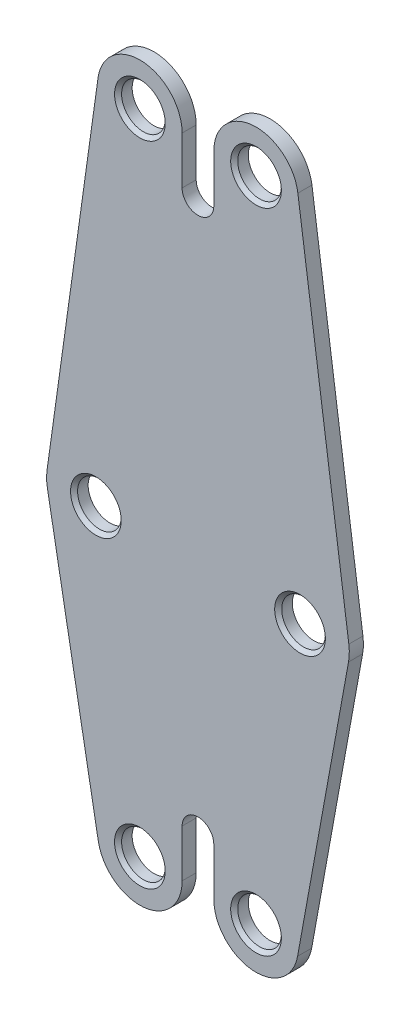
ISO-10303-21;
HEADER;
FILE_DESCRIPTION(('STEP AP214'),'2;1');
FILE_NAME('part.step','',(''),(''),'','','');
FILE_SCHEMA(('AUTOMOTIVE_DESIGN { 1 0 10303 214 1 1 1 1 }'));
ENDSEC;
DATA;
#1=APPLICATION_CONTEXT('core data for automotive mechanical design processes');
#2=APPLICATION_PROTOCOL_DEFINITION('international standard','automotive_design',2000,#1);
#3=PRODUCT_CONTEXT('',#1,'mechanical');
#4=PRODUCT('Part','Part','',(#3));
#5=PRODUCT_RELATED_PRODUCT_CATEGORY('part','',(#4));
#6=PRODUCT_DEFINITION_FORMATION('','',#4);
#7=PRODUCT_DEFINITION_CONTEXT('part definition',#1,'design');
#8=PRODUCT_DEFINITION('design','',#6,#7);
#9=PRODUCT_DEFINITION_SHAPE('','',#8);
#10=(LENGTH_UNIT() NAMED_UNIT(*) SI_UNIT(.MILLI.,.METRE.));
#11=(NAMED_UNIT(*) PLANE_ANGLE_UNIT() SI_UNIT($,.RADIAN.));
#12=(NAMED_UNIT(*) SI_UNIT($,.STERADIAN.) SOLID_ANGLE_UNIT());
#13=UNCERTAINTY_MEASURE_WITH_UNIT(LENGTH_MEASURE(1.E-05),#10,'distance_accuracy_value','');
#14=(GEOMETRIC_REPRESENTATION_CONTEXT(3) GLOBAL_UNCERTAINTY_ASSIGNED_CONTEXT((#13)) GLOBAL_UNIT_ASSIGNED_CONTEXT((#10,
#11,#12)) REPRESENTATION_CONTEXT('',''));
#15=CARTESIAN_POINT('',(0.,0.,0.));
#16=DIRECTION('',(0.,0.,1.));
#17=DIRECTION('',(1.,0.,0.));
#18=AXIS2_PLACEMENT_3D('',#15,#16,#17);
#19=CARTESIAN_POINT('',(-14.5,0.,2.));
#20=DIRECTION('',(0.,0.,1.));
#21=DIRECTION('',(1.,0.,0.));
#22=AXIS2_PLACEMENT_3D('',#19,#20,#21);
#23=PLANE('',#22);
#24=CARTESIAN_POINT('',(-8.25000000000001,52.,2.));
#25=DIRECTION('',(0.,0.,1.));
#26=DIRECTION('',(1.,0.,0.));
#27=AXIS2_PLACEMENT_3D('',#24,#25,#26);
#28=CIRCLE('',#27,3.6);
#29=CARTESIAN_POINT('',(-4.65,52.,2.));
#30=VERTEX_POINT('',#29);
#31=EDGE_CURVE('E289',#30,#30,#28,.F.);
#32=ORIENTED_EDGE('',*,*,#31,.T.);
#33=EDGE_LOOP('',(#32));
#34=FACE_BOUND('',#33,.T.);
#35=CARTESIAN_POINT('',(8.24999999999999,52.,2.));
#36=DIRECTION('',(0.,0.,1.));
#37=DIRECTION('',(1.,0.,0.));
#38=AXIS2_PLACEMENT_3D('',#35,#36,#37);
#39=CIRCLE('',#38,3.6);
#40=CARTESIAN_POINT('',(11.85,52.,2.));
#41=VERTEX_POINT('',#40);
#42=EDGE_CURVE('E286',#41,#41,#39,.F.);
#43=ORIENTED_EDGE('',*,*,#42,.T.);
#44=EDGE_LOOP('',(#43));
#45=FACE_BOUND('',#44,.T.);
#46=CARTESIAN_POINT('',(-14.5,0.,2.));
#47=DIRECTION('',(0.,0.,1.));
#48=DIRECTION('',(1.,0.,0.));
#49=AXIS2_PLACEMENT_3D('',#46,#47,#48);
#50=CIRCLE('',#49,3.60000000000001);
#51=CARTESIAN_POINT('',(-10.9,0.,2.));
#52=VERTEX_POINT('',#51);
#53=EDGE_CURVE('E283',#52,#52,#50,.F.);
#54=ORIENTED_EDGE('',*,*,#53,.T.);
#55=EDGE_LOOP('',(#54));
#56=FACE_BOUND('',#55,.T.);
#57=CARTESIAN_POINT('',(14.5,0.,2.));
#58=DIRECTION('',(0.,0.,1.));
#59=DIRECTION('',(1.,0.,0.));
#60=AXIS2_PLACEMENT_3D('',#57,#58,#59);
#61=CIRCLE('',#60,3.6);
#62=CARTESIAN_POINT('',(18.1,0.,2.));
#63=VERTEX_POINT('',#62);
#64=EDGE_CURVE('E280',#63,#63,#61,.F.);
#65=ORIENTED_EDGE('',*,*,#64,.T.);
#66=EDGE_LOOP('',(#65));
#67=FACE_BOUND('',#66,.T.);
#68=CARTESIAN_POINT('',(-8.24999999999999,-40.,2.));
#69=DIRECTION('',(0.,0.,1.));
#70=DIRECTION('',(1.,0.,0.));
#71=AXIS2_PLACEMENT_3D('',#68,#69,#70);
#72=CIRCLE('',#71,3.6);
#73=CARTESIAN_POINT('',(-4.64999999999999,-40.,2.));
#74=VERTEX_POINT('',#73);
#75=EDGE_CURVE('E277',#74,#74,#72,.F.);
#76=ORIENTED_EDGE('',*,*,#75,.T.);
#77=EDGE_LOOP('',(#76));
#78=FACE_BOUND('',#77,.T.);
#79=CARTESIAN_POINT('',(8.25000000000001,-40.,2.));
#80=DIRECTION('',(0.,0.,1.));
#81=DIRECTION('',(1.,0.,0.));
#82=AXIS2_PLACEMENT_3D('',#79,#80,#81);
#83=CIRCLE('',#82,3.6);
#84=CARTESIAN_POINT('',(11.85,-40.,2.));
#85=VERTEX_POINT('',#84);
#86=EDGE_CURVE('E274',#85,#85,#83,.F.);
#87=ORIENTED_EDGE('',*,*,#86,.T.);
#88=EDGE_LOOP('',(#87));
#89=FACE_BOUND('',#88,.T.);
#90=CARTESIAN_POINT('',(-14.5,0.,2.));
#91=DIRECTION('',(0.,0.,1.));
#92=DIRECTION('',(1.,0.,0.));
#93=AXIS2_PLACEMENT_3D('',#90,#91,#92);
#94=CIRCLE('',#93,7.00000000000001);
#95=CARTESIAN_POINT('',(-21.4327633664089,0.967880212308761,2.));
#96=VERTEX_POINT('',#95);
#97=CARTESIAN_POINT('',(-21.3872820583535,-1.25113782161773,2.));
#98=VERTEX_POINT('',#97);
#99=EDGE_CURVE('E202',#96,#98,#94,.T.);
#100=ORIENTED_EDGE('',*,*,#99,.T.);
#101=DIRECTION('',(0.178733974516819,-0.983897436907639,0.));
#102=VECTOR('',#101,1.);
#103=CARTESIAN_POINT('',(-21.3872820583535,-1.25113782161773,2.));
#104=LINE('',#103,#102);
#105=CARTESIAN_POINT('',(-14.1533846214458,-41.0724038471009,2.));
#106=VERTEX_POINT('',#105);
#107=EDGE_CURVE('E160',#98,#106,#104,.T.);
#108=ORIENTED_EDGE('',*,*,#107,.T.);
#109=CARTESIAN_POINT('',(-8.24999999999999,-40.,2.));
#110=DIRECTION('',(0.,0.,1.));
#111=DIRECTION('',(1.,0.,0.));
#112=AXIS2_PLACEMENT_3D('',#109,#110,#111);
#113=CIRCLE('',#112,6.);
#114=CARTESIAN_POINT('',(-2.25,-40.,2.));
#115=VERTEX_POINT('',#114);
#116=EDGE_CURVE('E205',#106,#115,#113,.T.);
#117=ORIENTED_EDGE('',*,*,#116,.T.);
#118=DIRECTION('',(0.,1.,0.));
#119=VECTOR('',#118,1.);
#120=CARTESIAN_POINT('',(-2.25,-33.25,2.));
#121=LINE('',#120,#119);
#122=CARTESIAN_POINT('',(-2.25,-33.25,2.));
#123=VERTEX_POINT('',#122);
#124=EDGE_CURVE('E207',#115,#123,#121,.T.);
#125=ORIENTED_EDGE('',*,*,#124,.T.);
#126=CARTESIAN_POINT('',(0.,-33.25,2.));
#127=DIRECTION('',(0.,0.,-1.));
#128=DIRECTION('',(1.,0.,0.));
#129=AXIS2_PLACEMENT_3D('',#126,#127,#128);
#130=CIRCLE('',#129,2.25);
#131=CARTESIAN_POINT('',(2.25,-33.25,2.));
#132=VERTEX_POINT('',#131);
#133=EDGE_CURVE('E209',#123,#132,#130,.T.);
#134=ORIENTED_EDGE('',*,*,#133,.T.);
#135=DIRECTION('',(0.,-1.,0.));
#136=VECTOR('',#135,1.);
#137=CARTESIAN_POINT('',(2.25,-33.25,2.));
#138=LINE('',#137,#136);
#139=CARTESIAN_POINT('',(2.25,-40.,2.));
#140=VERTEX_POINT('',#139);
#141=EDGE_CURVE('E211',#132,#140,#138,.T.);
#142=ORIENTED_EDGE('',*,*,#141,.T.);
#143=CARTESIAN_POINT('',(8.25000000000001,-40.,2.));
#144=DIRECTION('',(0.,0.,1.));
#145=DIRECTION('',(1.,0.,0.));
#146=AXIS2_PLACEMENT_3D('',#143,#144,#145);
#147=CIRCLE('',#146,6.);
#148=CARTESIAN_POINT('',(14.1533846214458,-41.0724038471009,2.));
#149=VERTEX_POINT('',#148);
#150=EDGE_CURVE('E213',#140,#149,#147,.T.);
#151=ORIENTED_EDGE('',*,*,#150,.T.);
#152=DIRECTION('',(0.178733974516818,0.983897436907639,0.));
#153=VECTOR('',#152,1.);
#154=CARTESIAN_POINT('',(21.3872820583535,-1.25113782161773,2.));
#155=LINE('',#154,#153);
#156=CARTESIAN_POINT('',(21.3872820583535,-1.25113782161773,2.));
#157=VERTEX_POINT('',#156);
#158=EDGE_CURVE('E215',#149,#157,#155,.T.);
#159=ORIENTED_EDGE('',*,*,#158,.T.);
#160=CARTESIAN_POINT('',(14.5,0.,2.));
#161=DIRECTION('',(0.,0.,1.));
#162=DIRECTION('',(1.,0.,0.));
#163=AXIS2_PLACEMENT_3D('',#160,#161,#162);
#164=CIRCLE('',#163,7.);
#165=CARTESIAN_POINT('',(21.4327633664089,0.967880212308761,2.));
#166=VERTEX_POINT('',#165);
#167=EDGE_CURVE('E217',#157,#166,#164,.T.);
#168=ORIENTED_EDGE('',*,*,#167,.T.);
#169=DIRECTION('',(-0.138268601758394,0.990394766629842,0.));
#170=VECTOR('',#169,1.);
#171=CARTESIAN_POINT('',(14.1923685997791,52.8296116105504,2.));
#172=LINE('',#171,#170);
#173=CARTESIAN_POINT('',(14.192368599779,52.8296116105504,2.));
#174=VERTEX_POINT('',#173);
#175=EDGE_CURVE('E219',#166,#174,#172,.T.);
#176=ORIENTED_EDGE('',*,*,#175,.T.);
#177=CARTESIAN_POINT('',(8.24999999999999,52.,2.));
#178=DIRECTION('',(0.,0.,1.));
#179=DIRECTION('',(1.,0.,0.));
#180=AXIS2_PLACEMENT_3D('',#177,#178,#179);
#181=CIRCLE('',#180,6.00000000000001);
#182=CARTESIAN_POINT('',(2.25,52.,2.));
#183=VERTEX_POINT('',#182);
#184=EDGE_CURVE('E221',#174,#183,#181,.T.);
#185=ORIENTED_EDGE('',*,*,#184,.T.);
#186=DIRECTION('',(0.,-1.,0.));
#187=VECTOR('',#186,1.);
#188=CARTESIAN_POINT('',(2.25,45.25,2.));
#189=LINE('',#188,#187);
#190=CARTESIAN_POINT('',(2.25,45.25,2.));
#191=VERTEX_POINT('',#190);
#192=EDGE_CURVE('E223',#183,#191,#189,.T.);
#193=ORIENTED_EDGE('',*,*,#192,.T.);
#194=CARTESIAN_POINT('',(0.,45.25,2.));
#195=DIRECTION('',(0.,0.,-1.));
#196=DIRECTION('',(-1.,0.,0.));
#197=AXIS2_PLACEMENT_3D('',#194,#195,#196);
#198=CIRCLE('',#197,2.25);
#199=CARTESIAN_POINT('',(-2.25,45.25,2.));
#200=VERTEX_POINT('',#199);
#201=EDGE_CURVE('E225',#191,#200,#198,.T.);
#202=ORIENTED_EDGE('',*,*,#201,.T.);
#203=DIRECTION('',(0.,1.,0.));
#204=VECTOR('',#203,1.);
#205=CARTESIAN_POINT('',(-2.25,45.25,2.));
#206=LINE('',#205,#204);
#207=CARTESIAN_POINT('',(-2.25000000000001,52.,2.));
#208=VERTEX_POINT('',#207);
#209=EDGE_CURVE('E227',#200,#208,#206,.T.);
#210=ORIENTED_EDGE('',*,*,#209,.T.);
#211=CARTESIAN_POINT('',(-8.25000000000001,52.,2.));
#212=DIRECTION('',(0.,0.,1.));
#213=DIRECTION('',(1.,0.,0.));
#214=AXIS2_PLACEMENT_3D('',#211,#212,#213);
#215=CIRCLE('',#214,6.);
#216=CARTESIAN_POINT('',(-14.1923685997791,52.8296116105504,2.));
#217=VERTEX_POINT('',#216);
#218=EDGE_CURVE('E51',#208,#217,#215,.T.);
#219=ORIENTED_EDGE('',*,*,#218,.T.);
#220=DIRECTION('',(-0.138268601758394,-0.990394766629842,0.));
#221=VECTOR('',#220,1.);
#222=CARTESIAN_POINT('',(-14.1923685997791,52.8296116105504,2.));
#223=LINE('',#222,#221);
#224=EDGE_CURVE('E46',#217,#96,#223,.T.);
#225=ORIENTED_EDGE('',*,*,#224,.T.);
#226=EDGE_LOOP('',(#100,#108,#117,#125,#134,#142,#151,#159,#168,#176,#185,#193,#202,#210,#219,#225));
#227=FACE_BOUND('',#226,.T.);
#228=ADVANCED_FACE('F31',(#34,#45,#56,#67,#78,#89,#227),#23,.T.);
#229=CARTESIAN_POINT('',(-14.5,0.,0.));
#230=DIRECTION('',(0.,0.,1.));
#231=DIRECTION('',(1.,0.,0.));
#232=AXIS2_PLACEMENT_3D('',#229,#230,#231);
#233=PLANE('',#232);
#234=CARTESIAN_POINT('',(-8.24999999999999,-40.,0.));
#235=DIRECTION('',(0.,0.,1.));
#236=DIRECTION('',(1.,0.,0.));
#237=AXIS2_PLACEMENT_3D('',#234,#235,#236);
#238=CIRCLE('',#237,3.1);
#239=CARTESIAN_POINT('',(-5.14999999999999,-40.,0.));
#240=VERTEX_POINT('',#239);
#241=EDGE_CURVE('E550',#240,#240,#238,.T.);
#242=ORIENTED_EDGE('',*,*,#241,.T.);
#243=EDGE_LOOP('',(#242));
#244=FACE_BOUND('',#243,.T.);
#245=CARTESIAN_POINT('',(-14.5,0.,0.));
#246=DIRECTION('',(0.,0.,1.));
#247=DIRECTION('',(1.,0.,0.));
#248=AXIS2_PLACEMENT_3D('',#245,#246,#247);
#249=CIRCLE('',#248,3.1);
#250=CARTESIAN_POINT('',(-11.4,0.,0.));
#251=VERTEX_POINT('',#250);
#252=EDGE_CURVE('E544',#251,#251,#249,.T.);
#253=ORIENTED_EDGE('',*,*,#252,.T.);
#254=EDGE_LOOP('',(#253));
#255=FACE_BOUND('',#254,.T.);
#256=CARTESIAN_POINT('',(-8.25000000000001,52.,0.));
#257=DIRECTION('',(0.,0.,1.));
#258=DIRECTION('',(1.,0.,0.));
#259=AXIS2_PLACEMENT_3D('',#256,#257,#258);
#260=CIRCLE('',#259,3.1);
#261=CARTESIAN_POINT('',(-5.15000000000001,52.,0.));
#262=VERTEX_POINT('',#261);
#263=EDGE_CURVE('E168',#262,#262,#260,.T.);
#264=ORIENTED_EDGE('',*,*,#263,.T.);
#265=EDGE_LOOP('',(#264));
#266=FACE_BOUND('',#265,.T.);
#267=CARTESIAN_POINT('',(-14.5,0.,0.));
#268=DIRECTION('',(0.,0.,1.));
#269=DIRECTION('',(1.,0.,0.));
#270=AXIS2_PLACEMENT_3D('',#267,#268,#269);
#271=CIRCLE('',#270,7.00000000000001);
#272=CARTESIAN_POINT('',(-21.4327633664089,0.967880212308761,0.));
#273=VERTEX_POINT('',#272);
#274=CARTESIAN_POINT('',(-21.3872820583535,-1.25113782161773,0.));
#275=VERTEX_POINT('',#274);
#276=EDGE_CURVE('E150',#273,#275,#271,.T.);
#277=ORIENTED_EDGE('',*,*,#276,.F.);
#278=DIRECTION('',(-0.138268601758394,-0.990394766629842,0.));
#279=VECTOR('',#278,1.);
#280=CARTESIAN_POINT('',(-14.1923685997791,52.8296116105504,0.));
#281=LINE('',#280,#279);
#282=CARTESIAN_POINT('',(-14.1923685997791,52.8296116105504,0.));
#283=VERTEX_POINT('',#282);
#284=EDGE_CURVE('E200',#283,#273,#281,.T.);
#285=ORIENTED_EDGE('',*,*,#284,.F.);
#286=CARTESIAN_POINT('',(-8.25000000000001,52.,0.));
#287=DIRECTION('',(0.,0.,1.));
#288=DIRECTION('',(1.,0.,0.));
#289=AXIS2_PLACEMENT_3D('',#286,#287,#288);
#290=CIRCLE('',#289,6.);
#291=CARTESIAN_POINT('',(-2.25000000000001,52.,0.));
#292=VERTEX_POINT('',#291);
#293=EDGE_CURVE('E198',#292,#283,#290,.T.);
#294=ORIENTED_EDGE('',*,*,#293,.F.);
#295=DIRECTION('',(0.,1.,0.));
#296=VECTOR('',#295,1.);
#297=CARTESIAN_POINT('',(-2.25,45.25,0.));
#298=LINE('',#297,#296);
#299=CARTESIAN_POINT('',(-2.25,45.25,0.));
#300=VERTEX_POINT('',#299);
#301=EDGE_CURVE('E196',#300,#292,#298,.T.);
#302=ORIENTED_EDGE('',*,*,#301,.F.);
#303=CARTESIAN_POINT('',(0.,45.25,0.));
#304=DIRECTION('',(0.,0.,-1.));
#305=DIRECTION('',(-1.,0.,0.));
#306=AXIS2_PLACEMENT_3D('',#303,#304,#305);
#307=CIRCLE('',#306,2.25);
#308=CARTESIAN_POINT('',(2.25,45.25,0.));
#309=VERTEX_POINT('',#308);
#310=EDGE_CURVE('E194',#309,#300,#307,.T.);
#311=ORIENTED_EDGE('',*,*,#310,.F.);
#312=DIRECTION('',(0.,-1.,0.));
#313=VECTOR('',#312,1.);
#314=CARTESIAN_POINT('',(2.25,45.25,0.));
#315=LINE('',#314,#313);
#316=CARTESIAN_POINT('',(2.25,52.,0.));
#317=VERTEX_POINT('',#316);
#318=EDGE_CURVE('E192',#317,#309,#315,.T.);
#319=ORIENTED_EDGE('',*,*,#318,.F.);
#320=CARTESIAN_POINT('',(8.24999999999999,52.,0.));
#321=DIRECTION('',(0.,0.,1.));
#322=DIRECTION('',(1.,0.,0.));
#323=AXIS2_PLACEMENT_3D('',#320,#321,#322);
#324=CIRCLE('',#323,6.00000000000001);
#325=CARTESIAN_POINT('',(14.192368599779,52.8296116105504,0.));
#326=VERTEX_POINT('',#325);
#327=EDGE_CURVE('E190',#326,#317,#324,.T.);
#328=ORIENTED_EDGE('',*,*,#327,.F.);
#329=DIRECTION('',(-0.138268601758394,0.990394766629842,0.));
#330=VECTOR('',#329,1.);
#331=CARTESIAN_POINT('',(14.1923685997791,52.8296116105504,0.));
#332=LINE('',#331,#330);
#333=CARTESIAN_POINT('',(21.4327633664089,0.967880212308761,0.));
#334=VERTEX_POINT('',#333);
#335=EDGE_CURVE('E188',#334,#326,#332,.T.);
#336=ORIENTED_EDGE('',*,*,#335,.F.);
#337=CARTESIAN_POINT('',(14.5,0.,0.));
#338=DIRECTION('',(0.,0.,1.));
#339=DIRECTION('',(1.,0.,0.));
#340=AXIS2_PLACEMENT_3D('',#337,#338,#339);
#341=CIRCLE('',#340,7.);
#342=CARTESIAN_POINT('',(21.3872820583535,-1.25113782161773,0.));
#343=VERTEX_POINT('',#342);
#344=EDGE_CURVE('E186',#343,#334,#341,.T.);
#345=ORIENTED_EDGE('',*,*,#344,.F.);
#346=DIRECTION('',(0.178733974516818,0.983897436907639,0.));
#347=VECTOR('',#346,1.);
#348=CARTESIAN_POINT('',(21.3872820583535,-1.25113782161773,0.));
#349=LINE('',#348,#347);
#350=CARTESIAN_POINT('',(14.1533846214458,-41.0724038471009,0.));
#351=VERTEX_POINT('',#350);
#352=EDGE_CURVE('E184',#351,#343,#349,.T.);
#353=ORIENTED_EDGE('',*,*,#352,.F.);
#354=CARTESIAN_POINT('',(8.25000000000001,-40.,0.));
#355=DIRECTION('',(0.,0.,1.));
#356=DIRECTION('',(1.,0.,0.));
#357=AXIS2_PLACEMENT_3D('',#354,#355,#356);
#358=CIRCLE('',#357,6.);
#359=CARTESIAN_POINT('',(2.25,-40.,0.));
#360=VERTEX_POINT('',#359);
#361=EDGE_CURVE('E182',#360,#351,#358,.T.);
#362=ORIENTED_EDGE('',*,*,#361,.F.);
#363=DIRECTION('',(0.,-1.,0.));
#364=VECTOR('',#363,1.);
#365=CARTESIAN_POINT('',(2.25,-33.25,0.));
#366=LINE('',#365,#364);
#367=CARTESIAN_POINT('',(2.25,-33.25,0.));
#368=VERTEX_POINT('',#367);
#369=EDGE_CURVE('E180',#368,#360,#366,.T.);
#370=ORIENTED_EDGE('',*,*,#369,.F.);
#371=CARTESIAN_POINT('',(0.,-33.25,0.));
#372=DIRECTION('',(0.,0.,-1.));
#373=DIRECTION('',(1.,0.,0.));
#374=AXIS2_PLACEMENT_3D('',#371,#372,#373);
#375=CIRCLE('',#374,2.25);
#376=CARTESIAN_POINT('',(-2.25,-33.25,0.));
#377=VERTEX_POINT('',#376);
#378=EDGE_CURVE('E178',#377,#368,#375,.T.);
#379=ORIENTED_EDGE('',*,*,#378,.F.);
#380=DIRECTION('',(0.,1.,0.));
#381=VECTOR('',#380,1.);
#382=CARTESIAN_POINT('',(-2.25,-33.25,0.));
#383=LINE('',#382,#381);
#384=CARTESIAN_POINT('',(-2.25,-40.,0.));
#385=VERTEX_POINT('',#384);
#386=EDGE_CURVE('E176',#385,#377,#383,.T.);
#387=ORIENTED_EDGE('',*,*,#386,.F.);
#388=CARTESIAN_POINT('',(-8.24999999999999,-40.,0.));
#389=DIRECTION('',(0.,0.,1.));
#390=DIRECTION('',(1.,0.,0.));
#391=AXIS2_PLACEMENT_3D('',#388,#389,#390);
#392=CIRCLE('',#391,6.);
#393=CARTESIAN_POINT('',(-14.1533846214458,-41.0724038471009,0.));
#394=VERTEX_POINT('',#393);
#395=EDGE_CURVE('E152',#394,#385,#392,.T.);
#396=ORIENTED_EDGE('',*,*,#395,.F.);
#397=DIRECTION('',(0.178733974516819,-0.983897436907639,0.));
#398=VECTOR('',#397,1.);
#399=CARTESIAN_POINT('',(-21.3872820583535,-1.25113782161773,0.));
#400=LINE('',#399,#398);
#401=EDGE_CURVE('E144',#275,#394,#400,.T.);
#402=ORIENTED_EDGE('',*,*,#401,.F.);
#403=EDGE_LOOP('',(#277,#285,#294,#302,#311,#319,#328,#336,#345,#353,#362,#370,#379,#387,#396,#402));
#404=FACE_BOUND('',#403,.T.);
#405=CARTESIAN_POINT('',(8.24999999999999,52.,0.));
#406=DIRECTION('',(0.,0.,1.));
#407=DIRECTION('',(1.,0.,0.));
#408=AXIS2_PLACEMENT_3D('',#405,#406,#407);
#409=CIRCLE('',#408,3.1);
#410=CARTESIAN_POINT('',(11.35,52.,0.));
#411=VERTEX_POINT('',#410);
#412=EDGE_CURVE('E171',#411,#411,#409,.T.);
#413=ORIENTED_EDGE('',*,*,#412,.T.);
#414=EDGE_LOOP('',(#413));
#415=FACE_BOUND('',#414,.T.);
#416=CARTESIAN_POINT('',(14.5,0.,0.));
#417=DIRECTION('',(0.,0.,1.));
#418=DIRECTION('',(1.,0.,0.));
#419=AXIS2_PLACEMENT_3D('',#416,#417,#418);
#420=CIRCLE('',#419,3.1);
#421=CARTESIAN_POINT('',(17.6,0.,0.));
#422=VERTEX_POINT('',#421);
#423=EDGE_CURVE('E546',#422,#422,#420,.T.);
#424=ORIENTED_EDGE('',*,*,#423,.T.);
#425=EDGE_LOOP('',(#424));
#426=FACE_BOUND('',#425,.T.);
#427=CARTESIAN_POINT('',(8.25000000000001,-40.,0.));
#428=DIRECTION('',(0.,0.,1.));
#429=DIRECTION('',(1.,0.,0.));
#430=AXIS2_PLACEMENT_3D('',#427,#428,#429);
#431=CIRCLE('',#430,3.1);
#432=CARTESIAN_POINT('',(11.35,-40.,0.));
#433=VERTEX_POINT('',#432);
#434=EDGE_CURVE('E555',#433,#433,#431,.T.);
#435=ORIENTED_EDGE('',*,*,#434,.T.);
#436=EDGE_LOOP('',(#435));
#437=FACE_BOUND('',#436,.T.);
#438=ADVANCED_FACE('F146',(#244,#255,#266,#404,#415,#426,#437),#233,.F.);
#439=CARTESIAN_POINT('',(-14.5,0.,2.));
#440=DIRECTION('',(0.,0.,-1.));
#441=DIRECTION('',(-1.,0.,0.));
#442=AXIS2_PLACEMENT_3D('',#439,#440,#441);
#443=CYLINDRICAL_SURFACE('',#442,7.00000000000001);
#444=ORIENTED_EDGE('',*,*,#276,.T.);
#445=DIRECTION('',(0.,0.,-1.));
#446=VECTOR('',#445,1.);
#447=CARTESIAN_POINT('',(-21.3872820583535,-1.25113782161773,2.));
#448=LINE('',#447,#446);
#449=EDGE_CURVE('E158',#98,#275,#448,.T.);
#450=ORIENTED_EDGE('',*,*,#449,.F.);
#451=ORIENTED_EDGE('',*,*,#99,.F.);
#452=DIRECTION('',(0.,0.,-1.));
#453=VECTOR('',#452,1.);
#454=CARTESIAN_POINT('',(-21.4327633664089,0.967880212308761,2.));
#455=LINE('',#454,#453);
#456=EDGE_CURVE('E167',#96,#273,#455,.T.);
#457=ORIENTED_EDGE('',*,*,#456,.T.);
#458=EDGE_LOOP('',(#444,#450,#451,#457));
#459=FACE_BOUND('',#458,.T.);
#460=ADVANCED_FACE('F33',(#459),#443,.T.);
#461=CARTESIAN_POINT('',(-21.3872820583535,-1.25113782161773,2.));
#462=DIRECTION('',(0.983897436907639,0.178733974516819,0.));
#463=DIRECTION('',(-0.178733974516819,0.983897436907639,0.));
#464=AXIS2_PLACEMENT_3D('',#461,#462,#463);
#465=PLANE('',#464);
#466=ORIENTED_EDGE('',*,*,#401,.T.);
#467=DIRECTION('',(0.,0.,-1.));
#468=VECTOR('',#467,1.);
#469=CARTESIAN_POINT('',(-14.1533846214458,-41.0724038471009,2.));
#470=LINE('',#469,#468);
#471=EDGE_CURVE('E164',#106,#394,#470,.T.);
#472=ORIENTED_EDGE('',*,*,#471,.F.);
#473=ORIENTED_EDGE('',*,*,#107,.F.);
#474=ORIENTED_EDGE('',*,*,#449,.T.);
#475=EDGE_LOOP('',(#466,#472,#473,#474));
#476=FACE_BOUND('',#475,.T.);
#477=ADVANCED_FACE('F159',(#476),#465,.F.);
#478=CARTESIAN_POINT('',(-8.24999999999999,-40.,2.));
#479=DIRECTION('',(0.,0.,-1.));
#480=DIRECTION('',(-1.,0.,0.));
#481=AXIS2_PLACEMENT_3D('',#478,#479,#480);
#482=CYLINDRICAL_SURFACE('',#481,6.);
#483=ORIENTED_EDGE('',*,*,#395,.T.);
#484=DIRECTION('',(0.,0.,-1.));
#485=VECTOR('',#484,1.);
#486=CARTESIAN_POINT('',(-2.25,-40.,2.));
#487=LINE('',#486,#485);
#488=EDGE_CURVE('E268',#115,#385,#487,.T.);
#489=ORIENTED_EDGE('',*,*,#488,.F.);
#490=ORIENTED_EDGE('',*,*,#116,.F.);
#491=ORIENTED_EDGE('',*,*,#471,.T.);
#492=EDGE_LOOP('',(#483,#489,#490,#491));
#493=FACE_BOUND('',#492,.T.);
#494=ADVANCED_FACE('F385',(#493),#482,.T.);
#495=CARTESIAN_POINT('',(-2.25,-33.25,2.));
#496=DIRECTION('',(-1.,0.,0.));
#497=DIRECTION('',(0.,-1.,0.));
#498=AXIS2_PLACEMENT_3D('',#495,#496,#497);
#499=PLANE('',#498);
#500=ORIENTED_EDGE('',*,*,#386,.T.);
#501=DIRECTION('',(0.,0.,-1.));
#502=VECTOR('',#501,1.);
#503=CARTESIAN_POINT('',(-2.25,-33.25,2.));
#504=LINE('',#503,#502);
#505=EDGE_CURVE('E265',#123,#377,#504,.T.);
#506=ORIENTED_EDGE('',*,*,#505,.F.);
#507=ORIENTED_EDGE('',*,*,#124,.F.);
#508=ORIENTED_EDGE('',*,*,#488,.T.);
#509=EDGE_LOOP('',(#500,#506,#507,#508));
#510=FACE_BOUND('',#509,.T.);
#511=ADVANCED_FACE('F381',(#510),#499,.F.);
#512=CARTESIAN_POINT('',(0.,-33.25,2.));
#513=DIRECTION('',(0.,0.,-1.));
#514=DIRECTION('',(-1.,0.,0.));
#515=AXIS2_PLACEMENT_3D('',#512,#513,#514);
#516=CYLINDRICAL_SURFACE('',#515,2.25);
#517=ORIENTED_EDGE('',*,*,#378,.T.);
#518=DIRECTION('',(0.,0.,-1.));
#519=VECTOR('',#518,1.);
#520=CARTESIAN_POINT('',(2.25,-33.25,2.));
#521=LINE('',#520,#519);
#522=EDGE_CURVE('E262',#132,#368,#521,.T.);
#523=ORIENTED_EDGE('',*,*,#522,.F.);
#524=ORIENTED_EDGE('',*,*,#133,.F.);
#525=ORIENTED_EDGE('',*,*,#505,.T.);
#526=EDGE_LOOP('',(#517,#523,#524,#525));
#527=FACE_BOUND('',#526,.T.);
#528=ADVANCED_FACE('F377',(#527),#516,.F.);
#529=CARTESIAN_POINT('',(2.25,-33.25,2.));
#530=DIRECTION('',(1.,0.,0.));
#531=DIRECTION('',(0.,1.,0.));
#532=AXIS2_PLACEMENT_3D('',#529,#530,#531);
#533=PLANE('',#532);
#534=ORIENTED_EDGE('',*,*,#369,.T.);
#535=DIRECTION('',(0.,0.,-1.));
#536=VECTOR('',#535,1.);
#537=CARTESIAN_POINT('',(2.25,-40.,2.));
#538=LINE('',#537,#536);
#539=EDGE_CURVE('E259',#140,#360,#538,.T.);
#540=ORIENTED_EDGE('',*,*,#539,.F.);
#541=ORIENTED_EDGE('',*,*,#141,.F.);
#542=ORIENTED_EDGE('',*,*,#522,.T.);
#543=EDGE_LOOP('',(#534,#540,#541,#542));
#544=FACE_BOUND('',#543,.T.);
#545=ADVANCED_FACE('F373',(#544),#533,.F.);
#546=CARTESIAN_POINT('',(8.25000000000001,-40.,2.));
#547=DIRECTION('',(0.,0.,-1.));
#548=DIRECTION('',(-1.,0.,0.));
#549=AXIS2_PLACEMENT_3D('',#546,#547,#548);
#550=CYLINDRICAL_SURFACE('',#549,6.);
#551=ORIENTED_EDGE('',*,*,#361,.T.);
#552=DIRECTION('',(0.,0.,-1.));
#553=VECTOR('',#552,1.);
#554=CARTESIAN_POINT('',(14.1533846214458,-41.0724038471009,2.));
#555=LINE('',#554,#553);
#556=EDGE_CURVE('E256',#149,#351,#555,.T.);
#557=ORIENTED_EDGE('',*,*,#556,.F.);
#558=ORIENTED_EDGE('',*,*,#150,.F.);
#559=ORIENTED_EDGE('',*,*,#539,.T.);
#560=EDGE_LOOP('',(#551,#557,#558,#559));
#561=FACE_BOUND('',#560,.T.);
#562=ADVANCED_FACE('F369',(#561),#550,.T.);
#563=CARTESIAN_POINT('',(21.3872820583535,-1.25113782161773,2.));
#564=DIRECTION('',(-0.983897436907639,0.178733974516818,0.));
#565=DIRECTION('',(-0.178733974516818,-0.983897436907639,0.));
#566=AXIS2_PLACEMENT_3D('',#563,#564,#565);
#567=PLANE('',#566);
#568=ORIENTED_EDGE('',*,*,#352,.T.);
#569=DIRECTION('',(0.,0.,-1.));
#570=VECTOR('',#569,1.);
#571=CARTESIAN_POINT('',(21.3872820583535,-1.25113782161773,2.));
#572=LINE('',#571,#570);
#573=EDGE_CURVE('E253',#157,#343,#572,.T.);
#574=ORIENTED_EDGE('',*,*,#573,.F.);
#575=ORIENTED_EDGE('',*,*,#158,.F.);
#576=ORIENTED_EDGE('',*,*,#556,.T.);
#577=EDGE_LOOP('',(#568,#574,#575,#576));
#578=FACE_BOUND('',#577,.T.);
#579=ADVANCED_FACE('F365',(#578),#567,.F.);
#580=CARTESIAN_POINT('',(14.5,0.,2.));
#581=DIRECTION('',(0.,0.,-1.));
#582=DIRECTION('',(-1.,0.,0.));
#583=AXIS2_PLACEMENT_3D('',#580,#581,#582);
#584=CYLINDRICAL_SURFACE('',#583,7.);
#585=ORIENTED_EDGE('',*,*,#344,.T.);
#586=DIRECTION('',(0.,0.,-1.));
#587=VECTOR('',#586,1.);
#588=CARTESIAN_POINT('',(21.4327633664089,0.967880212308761,2.));
#589=LINE('',#588,#587);
#590=EDGE_CURVE('E250',#166,#334,#589,.T.);
#591=ORIENTED_EDGE('',*,*,#590,.F.);
#592=ORIENTED_EDGE('',*,*,#167,.F.);
#593=ORIENTED_EDGE('',*,*,#573,.T.);
#594=EDGE_LOOP('',(#585,#591,#592,#593));
#595=FACE_BOUND('',#594,.T.);
#596=ADVANCED_FACE('F361',(#595),#584,.T.);
#597=CARTESIAN_POINT('',(14.1923685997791,52.8296116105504,2.));
#598=DIRECTION('',(-0.990394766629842,-0.138268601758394,0.));
#599=DIRECTION('',(0.138268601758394,-0.990394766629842,0.));
#600=AXIS2_PLACEMENT_3D('',#597,#598,#599);
#601=PLANE('',#600);
#602=ORIENTED_EDGE('',*,*,#335,.T.);
#603=DIRECTION('',(0.,0.,-1.));
#604=VECTOR('',#603,1.);
#605=CARTESIAN_POINT('',(14.192368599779,52.8296116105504,2.));
#606=LINE('',#605,#604);
#607=EDGE_CURVE('E247',#174,#326,#606,.T.);
#608=ORIENTED_EDGE('',*,*,#607,.F.);
#609=ORIENTED_EDGE('',*,*,#175,.F.);
#610=ORIENTED_EDGE('',*,*,#590,.T.);
#611=EDGE_LOOP('',(#602,#608,#609,#610));
#612=FACE_BOUND('',#611,.T.);
#613=ADVANCED_FACE('F357',(#612),#601,.F.);
#614=CARTESIAN_POINT('',(8.24999999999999,52.,2.));
#615=DIRECTION('',(0.,0.,-1.));
#616=DIRECTION('',(-1.,0.,0.));
#617=AXIS2_PLACEMENT_3D('',#614,#615,#616);
#618=CYLINDRICAL_SURFACE('',#617,6.00000000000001);
#619=ORIENTED_EDGE('',*,*,#327,.T.);
#620=DIRECTION('',(0.,0.,-1.));
#621=VECTOR('',#620,1.);
#622=CARTESIAN_POINT('',(2.25,52.,2.));
#623=LINE('',#622,#621);
#624=EDGE_CURVE('E244',#183,#317,#623,.T.);
#625=ORIENTED_EDGE('',*,*,#624,.F.);
#626=ORIENTED_EDGE('',*,*,#184,.F.);
#627=ORIENTED_EDGE('',*,*,#607,.T.);
#628=EDGE_LOOP('',(#619,#625,#626,#627));
#629=FACE_BOUND('',#628,.T.);
#630=ADVANCED_FACE('F353',(#629),#618,.T.);
#631=CARTESIAN_POINT('',(2.25,45.25,2.));
#632=DIRECTION('',(1.,0.,0.));
#633=DIRECTION('',(0.,1.,0.));
#634=AXIS2_PLACEMENT_3D('',#631,#632,#633);
#635=PLANE('',#634);
#636=ORIENTED_EDGE('',*,*,#318,.T.);
#637=DIRECTION('',(0.,0.,-1.));
#638=VECTOR('',#637,1.);
#639=CARTESIAN_POINT('',(2.25,45.25,2.));
#640=LINE('',#639,#638);
#641=EDGE_CURVE('E241',#191,#309,#640,.T.);
#642=ORIENTED_EDGE('',*,*,#641,.F.);
#643=ORIENTED_EDGE('',*,*,#192,.F.);
#644=ORIENTED_EDGE('',*,*,#624,.T.);
#645=EDGE_LOOP('',(#636,#642,#643,#644));
#646=FACE_BOUND('',#645,.T.);
#647=ADVANCED_FACE('F349',(#646),#635,.F.);
#648=CARTESIAN_POINT('',(0.,45.25,2.));
#649=DIRECTION('',(0.,0.,-1.));
#650=DIRECTION('',(-1.,0.,0.));
#651=AXIS2_PLACEMENT_3D('',#648,#649,#650);
#652=CYLINDRICAL_SURFACE('',#651,2.25);
#653=ORIENTED_EDGE('',*,*,#310,.T.);
#654=DIRECTION('',(0.,0.,-1.));
#655=VECTOR('',#654,1.);
#656=CARTESIAN_POINT('',(-2.25,45.25,2.));
#657=LINE('',#656,#655);
#658=EDGE_CURVE('E238',#200,#300,#657,.T.);
#659=ORIENTED_EDGE('',*,*,#658,.F.);
#660=ORIENTED_EDGE('',*,*,#201,.F.);
#661=ORIENTED_EDGE('',*,*,#641,.T.);
#662=EDGE_LOOP('',(#653,#659,#660,#661));
#663=FACE_BOUND('',#662,.T.);
#664=ADVANCED_FACE('F345',(#663),#652,.F.);
#665=CARTESIAN_POINT('',(-2.25,45.25,2.));
#666=DIRECTION('',(-1.,0.,0.));
#667=DIRECTION('',(0.,-1.,0.));
#668=AXIS2_PLACEMENT_3D('',#665,#666,#667);
#669=PLANE('',#668);
#670=ORIENTED_EDGE('',*,*,#301,.T.);
#671=DIRECTION('',(0.,0.,-1.));
#672=VECTOR('',#671,1.);
#673=CARTESIAN_POINT('',(-2.25000000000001,52.,2.));
#674=LINE('',#673,#672);
#675=EDGE_CURVE('E235',#208,#292,#674,.T.);
#676=ORIENTED_EDGE('',*,*,#675,.F.);
#677=ORIENTED_EDGE('',*,*,#209,.F.);
#678=ORIENTED_EDGE('',*,*,#658,.T.);
#679=EDGE_LOOP('',(#670,#676,#677,#678));
#680=FACE_BOUND('',#679,.T.);
#681=ADVANCED_FACE('F341',(#680),#669,.F.);
#682=CARTESIAN_POINT('',(-8.25000000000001,52.,2.));
#683=DIRECTION('',(0.,0.,-1.));
#684=DIRECTION('',(-1.,0.,0.));
#685=AXIS2_PLACEMENT_3D('',#682,#683,#684);
#686=CYLINDRICAL_SURFACE('',#685,6.);
#687=ORIENTED_EDGE('',*,*,#293,.T.);
#688=DIRECTION('',(0.,0.,-1.));
#689=VECTOR('',#688,1.);
#690=CARTESIAN_POINT('',(-14.1923685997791,52.8296116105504,2.));
#691=LINE('',#690,#689);
#692=EDGE_CURVE('E232',#217,#283,#691,.T.);
#693=ORIENTED_EDGE('',*,*,#692,.F.);
#694=ORIENTED_EDGE('',*,*,#218,.F.);
#695=ORIENTED_EDGE('',*,*,#675,.T.);
#696=EDGE_LOOP('',(#687,#693,#694,#695));
#697=FACE_BOUND('',#696,.T.);
#698=ADVANCED_FACE('F337',(#697),#686,.T.);
#699=CARTESIAN_POINT('',(-14.1923685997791,52.8296116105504,2.));
#700=DIRECTION('',(0.990394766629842,-0.138268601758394,0.));
#701=DIRECTION('',(0.138268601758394,0.990394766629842,0.));
#702=AXIS2_PLACEMENT_3D('',#699,#700,#701);
#703=PLANE('',#702);
#704=ORIENTED_EDGE('',*,*,#284,.T.);
#705=ORIENTED_EDGE('',*,*,#456,.F.);
#706=ORIENTED_EDGE('',*,*,#224,.F.);
#707=ORIENTED_EDGE('',*,*,#692,.T.);
#708=EDGE_LOOP('',(#704,#705,#706,#707));
#709=FACE_BOUND('',#708,.T.);
#710=ADVANCED_FACE('F333',(#709),#703,.F.);
#711=CARTESIAN_POINT('',(-8.25000000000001,52.,2.));
#712=DIRECTION('',(0.,0.,-1.));
#713=DIRECTION('',(-1.,0.,0.));
#714=AXIS2_PLACEMENT_3D('',#711,#712,#713);
#715=CYLINDRICAL_SURFACE('',#714,3.1);
#716=CARTESIAN_POINT('',(-8.25000000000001,52.,1.5));
#717=DIRECTION('',(0.,0.,1.));
#718=DIRECTION('',(1.,0.,0.));
#719=AXIS2_PLACEMENT_3D('',#716,#717,#718);
#720=CIRCLE('',#719,3.1);
#721=CARTESIAN_POINT('',(-5.15000000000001,52.,1.5));
#722=VERTEX_POINT('',#721);
#723=EDGE_CURVE('E163',#722,#722,#720,.T.);
#724=ORIENTED_EDGE('',*,*,#723,.T.);
#725=EDGE_LOOP('',(#724));
#726=FACE_BOUND('',#725,.T.);
#727=ORIENTED_EDGE('',*,*,#263,.F.);
#728=EDGE_LOOP('',(#727));
#729=FACE_BOUND('',#728,.T.);
#730=ADVANCED_FACE('F336',(#726,#729),#715,.F.);
#731=CARTESIAN_POINT('',(8.24999999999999,52.,2.));
#732=DIRECTION('',(0.,0.,-1.));
#733=DIRECTION('',(-1.,0.,0.));
#734=AXIS2_PLACEMENT_3D('',#731,#732,#733);
#735=CYLINDRICAL_SURFACE('',#734,3.1);
#736=CARTESIAN_POINT('',(8.24999999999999,52.,1.5));
#737=DIRECTION('',(0.,0.,1.));
#738=DIRECTION('',(1.,0.,0.));
#739=AXIS2_PLACEMENT_3D('',#736,#737,#738);
#740=CIRCLE('',#739,3.1);
#741=CARTESIAN_POINT('',(11.35,52.,1.5));
#742=VERTEX_POINT('',#741);
#743=EDGE_CURVE('E292',#742,#742,#740,.T.);
#744=ORIENTED_EDGE('',*,*,#743,.T.);
#745=EDGE_LOOP('',(#744));
#746=FACE_BOUND('',#745,.T.);
#747=ORIENTED_EDGE('',*,*,#412,.F.);
#748=EDGE_LOOP('',(#747));
#749=FACE_BOUND('',#748,.T.);
#750=ADVANCED_FACE('F466',(#746,#749),#735,.F.);
#751=CARTESIAN_POINT('',(-14.5,0.,2.));
#752=DIRECTION('',(0.,0.,-1.));
#753=DIRECTION('',(-1.,0.,0.));
#754=AXIS2_PLACEMENT_3D('',#751,#752,#753);
#755=CYLINDRICAL_SURFACE('',#754,3.1);
#756=CARTESIAN_POINT('',(-14.5,0.,1.5));
#757=DIRECTION('',(0.,0.,1.));
#758=DIRECTION('',(1.,0.,0.));
#759=AXIS2_PLACEMENT_3D('',#756,#757,#758);
#760=CIRCLE('',#759,3.1);
#761=CARTESIAN_POINT('',(-11.4,0.,1.5));
#762=VERTEX_POINT('',#761);
#763=EDGE_CURVE('E295',#762,#762,#760,.T.);
#764=ORIENTED_EDGE('',*,*,#763,.T.);
#765=EDGE_LOOP('',(#764));
#766=FACE_BOUND('',#765,.T.);
#767=ORIENTED_EDGE('',*,*,#252,.F.);
#768=EDGE_LOOP('',(#767));
#769=FACE_BOUND('',#768,.T.);
#770=ADVANCED_FACE('F473',(#766,#769),#755,.F.);
#771=CARTESIAN_POINT('',(14.5,0.,2.));
#772=DIRECTION('',(0.,0.,-1.));
#773=DIRECTION('',(-1.,0.,0.));
#774=AXIS2_PLACEMENT_3D('',#771,#772,#773);
#775=CYLINDRICAL_SURFACE('',#774,3.1);
#776=CARTESIAN_POINT('',(14.5,0.,1.5));
#777=DIRECTION('',(0.,0.,1.));
#778=DIRECTION('',(1.,0.,0.));
#779=AXIS2_PLACEMENT_3D('',#776,#777,#778);
#780=CIRCLE('',#779,3.1);
#781=CARTESIAN_POINT('',(17.6,0.,1.5));
#782=VERTEX_POINT('',#781);
#783=EDGE_CURVE('E298',#782,#782,#780,.T.);
#784=ORIENTED_EDGE('',*,*,#783,.T.);
#785=EDGE_LOOP('',(#784));
#786=FACE_BOUND('',#785,.T.);
#787=ORIENTED_EDGE('',*,*,#423,.F.);
#788=EDGE_LOOP('',(#787));
#789=FACE_BOUND('',#788,.T.);
#790=ADVANCED_FACE('F481',(#786,#789),#775,.F.);
#791=CARTESIAN_POINT('',(-8.24999999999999,-40.,2.));
#792=DIRECTION('',(0.,0.,-1.));
#793=DIRECTION('',(-1.,0.,0.));
#794=AXIS2_PLACEMENT_3D('',#791,#792,#793);
#795=CYLINDRICAL_SURFACE('',#794,3.1);
#796=CARTESIAN_POINT('',(-8.24999999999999,-40.,1.5));
#797=DIRECTION('',(0.,0.,1.));
#798=DIRECTION('',(1.,0.,0.));
#799=AXIS2_PLACEMENT_3D('',#796,#797,#798);
#800=CIRCLE('',#799,3.1);
#801=CARTESIAN_POINT('',(-5.14999999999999,-40.,1.5));
#802=VERTEX_POINT('',#801);
#803=EDGE_CURVE('E39',#802,#802,#800,.T.);
#804=ORIENTED_EDGE('',*,*,#803,.T.);
#805=EDGE_LOOP('',(#804));
#806=FACE_BOUND('',#805,.T.);
#807=ORIENTED_EDGE('',*,*,#241,.F.);
#808=EDGE_LOOP('',(#807));
#809=FACE_BOUND('',#808,.T.);
#810=ADVANCED_FACE('F303',(#806,#809),#795,.F.);
#811=CARTESIAN_POINT('',(8.25000000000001,-40.,2.));
#812=DIRECTION('',(0.,0.,-1.));
#813=DIRECTION('',(-1.,0.,0.));
#814=AXIS2_PLACEMENT_3D('',#811,#812,#813);
#815=CYLINDRICAL_SURFACE('',#814,3.1);
#816=CARTESIAN_POINT('',(8.25000000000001,-40.,1.5));
#817=DIRECTION('',(0.,0.,1.));
#818=DIRECTION('',(1.,0.,0.));
#819=AXIS2_PLACEMENT_3D('',#816,#817,#818);
#820=CIRCLE('',#819,3.1);
#821=CARTESIAN_POINT('',(11.35,-40.,1.5));
#822=VERTEX_POINT('',#821);
#823=EDGE_CURVE('E11',#822,#822,#820,.T.);
#824=ORIENTED_EDGE('',*,*,#823,.T.);
#825=EDGE_LOOP('',(#824));
#826=FACE_BOUND('',#825,.T.);
#827=ORIENTED_EDGE('',*,*,#434,.F.);
#828=EDGE_LOOP('',(#827));
#829=FACE_BOUND('',#828,.T.);
#830=ADVANCED_FACE('F496',(#826,#829),#815,.F.);
#831=CARTESIAN_POINT('',(-8.25000000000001,52.,1.5));
#832=DIRECTION('',(0.,0.,1.));
#833=DIRECTION('',(1.,0.,0.));
#834=AXIS2_PLACEMENT_3D('',#831,#832,#833);
#835=CONICAL_SURFACE('',#834,3.1,0.78539816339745);
#836=ORIENTED_EDGE('',*,*,#31,.F.);
#837=EDGE_LOOP('',(#836));
#838=FACE_BOUND('',#837,.T.);
#839=ORIENTED_EDGE('',*,*,#723,.F.);
#840=EDGE_LOOP('',(#839));
#841=FACE_BOUND('',#840,.T.);
#842=ADVANCED_FACE('F503',(#838,#841),#835,.F.);
#843=CARTESIAN_POINT('',(8.24999999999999,52.,1.5));
#844=DIRECTION('',(0.,0.,1.));
#845=DIRECTION('',(1.,0.,0.));
#846=AXIS2_PLACEMENT_3D('',#843,#844,#845);
#847=CONICAL_SURFACE('',#846,3.1,0.785398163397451);
#848=ORIENTED_EDGE('',*,*,#42,.F.);
#849=EDGE_LOOP('',(#848));
#850=FACE_BOUND('',#849,.T.);
#851=ORIENTED_EDGE('',*,*,#743,.F.);
#852=EDGE_LOOP('',(#851));
#853=FACE_BOUND('',#852,.T.);
#854=ADVANCED_FACE('F511',(#850,#853),#847,.F.);
#855=CARTESIAN_POINT('',(-14.5,0.,1.5));
#856=DIRECTION('',(0.,0.,1.));
#857=DIRECTION('',(1.,0.,0.));
#858=AXIS2_PLACEMENT_3D('',#855,#856,#857);
#859=CONICAL_SURFACE('',#858,3.1,0.785398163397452);
#860=ORIENTED_EDGE('',*,*,#53,.F.);
#861=EDGE_LOOP('',(#860));
#862=FACE_BOUND('',#861,.T.);
#863=ORIENTED_EDGE('',*,*,#763,.F.);
#864=EDGE_LOOP('',(#863));
#865=FACE_BOUND('',#864,.T.);
#866=ADVANCED_FACE('F318',(#862,#865),#859,.F.);
#867=CARTESIAN_POINT('',(14.5,0.,1.5));
#868=DIRECTION('',(0.,0.,1.));
#869=DIRECTION('',(1.,0.,0.));
#870=AXIS2_PLACEMENT_3D('',#867,#868,#869);
#871=CONICAL_SURFACE('',#870,3.1,0.78539816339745);
#872=ORIENTED_EDGE('',*,*,#64,.F.);
#873=EDGE_LOOP('',(#872));
#874=FACE_BOUND('',#873,.T.);
#875=ORIENTED_EDGE('',*,*,#783,.F.);
#876=EDGE_LOOP('',(#875));
#877=FACE_BOUND('',#876,.T.);
#878=ADVANCED_FACE('F309',(#874,#877),#871,.F.);
#879=CARTESIAN_POINT('',(-8.24999999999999,-40.,1.5));
#880=DIRECTION('',(0.,0.,1.));
#881=DIRECTION('',(1.,0.,0.));
#882=AXIS2_PLACEMENT_3D('',#879,#880,#881);
#883=CONICAL_SURFACE('',#882,3.1,0.78539816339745);
#884=ORIENTED_EDGE('',*,*,#75,.F.);
#885=EDGE_LOOP('',(#884));
#886=FACE_BOUND('',#885,.T.);
#887=ORIENTED_EDGE('',*,*,#803,.F.);
#888=EDGE_LOOP('',(#887));
#889=FACE_BOUND('',#888,.T.);
#890=ADVANCED_FACE('F306',(#886,#889),#883,.F.);
#891=CARTESIAN_POINT('',(8.25000000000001,-40.,1.5));
#892=DIRECTION('',(0.,0.,1.));
#893=DIRECTION('',(1.,0.,0.));
#894=AXIS2_PLACEMENT_3D('',#891,#892,#893);
#895=CONICAL_SURFACE('',#894,3.1,0.785398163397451);
#896=ORIENTED_EDGE('',*,*,#86,.F.);
#897=EDGE_LOOP('',(#896));
#898=FACE_BOUND('',#897,.T.);
#899=ORIENTED_EDGE('',*,*,#823,.F.);
#900=EDGE_LOOP('',(#899));
#901=FACE_BOUND('',#900,.T.);
#902=ADVANCED_FACE('F308',(#898,#901),#895,.F.);
#903=CLOSED_SHELL('',(#228,#438,#460,#477,#494,#511,#528,#545,#562,#579,#596,#613,#630,#647,
#664,#681,#698,#710,#730,#750,#770,#790,#810,#830,#842,#854,#866,#878,#890,#902));
#904=MANIFOLD_SOLID_BREP('B2',#903);
#905=ADVANCED_BREP_SHAPE_REPRESENTATION('',(#18,#904),#14);
#906=SHAPE_DEFINITION_REPRESENTATION(#9,#905);
ENDSEC;
END-ISO-10303-21;
